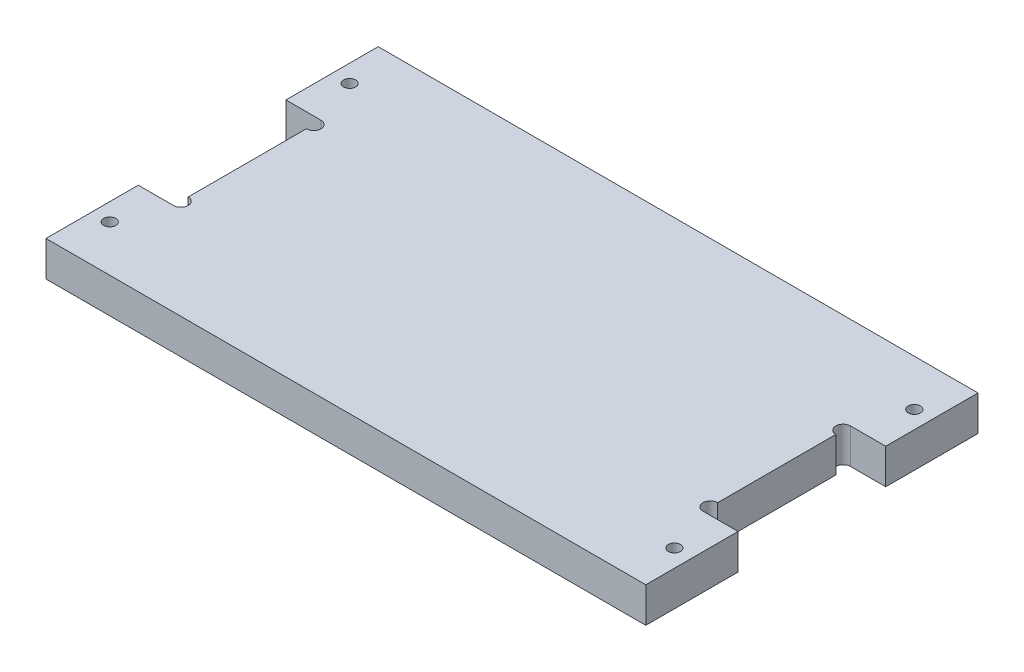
from build123d import *

# Parameters (mm, degrees)
SKETCH1_W                      = 325
SKETCH1_H                      = 180
BOSS_EXTRUDE1_DEPTH            = 19.05
END_JOINERY_DEPTH              = 373.005245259
CBORE_FOR_M6_SHCS1_D           = 6.6
CBORE_FOR_M6_SHCS1_CBORE_D     = 11
CBORE_FOR_M6_SHCS1_CBORE_DEPTH = 6


with BuildPart() as part:
    # Sketch1 → Boss-Extrude1 (new body)
    with BuildSketch(Plane(origin=(0, 0, 0), x_dir=(1, 0, 0), z_dir=(0, 1, 0))):
        with Locations((162.5, 90)):
            Rectangle(SKETCH1_W, SKETCH1_H)
    extrude(amount=BOSS_EXTRUDE1_DEPTH)

    # Sketch2 → end joinery (cut, through all)
    with BuildSketch(Plane(origin=(0, 19.05, 0), x_dir=(1, 0, 0), z_dir=(0, 1, 0))):
        with BuildLine():
            Line((19.05, 58), (19.05, 122))
            ThreePointArc((19.05, 122), (23.05, 126), (19.05, 130))
            Line((19.05, 130), (0, 130))
            Line((0, 130), (0, 50))
            Line((0, 50), (19.05, 50))
            ThreePointArc((19.05, 50), (23.05, 54), (19.05, 58))
        make_face()
        with BuildLine():
            Line((325, 50), (305.95, 50))
            ThreePointArc((305.95, 50), (301.95, 54), (305.95, 58))
            Line((305.95, 58), (305.95, 122))
            ThreePointArc((305.95, 122), (301.95, 126), (305.95, 130))
            Line((305.95, 130), (325, 130))
            Line((325, 130), (325, 50))
        make_face()
    extrude(amount=-END_JOINERY_DEPTH, mode=Mode.SUBTRACT)

    # CBORE for M6 SHCS1 (through all)
    with Locations(Plane(origin=(0, 0, 0), x_dir=(-1, 0, 0), z_dir=(0, -1, 0))):
        with Locations((-315.475, 25), (-315.475, 155), (-9.525, 25), (-9.525, 155)):
            CounterBoreHole(CBORE_FOR_M6_SHCS1_D / 2, CBORE_FOR_M6_SHCS1_CBORE_D / 2, CBORE_FOR_M6_SHCS1_CBORE_DEPTH)


solid = part.part
